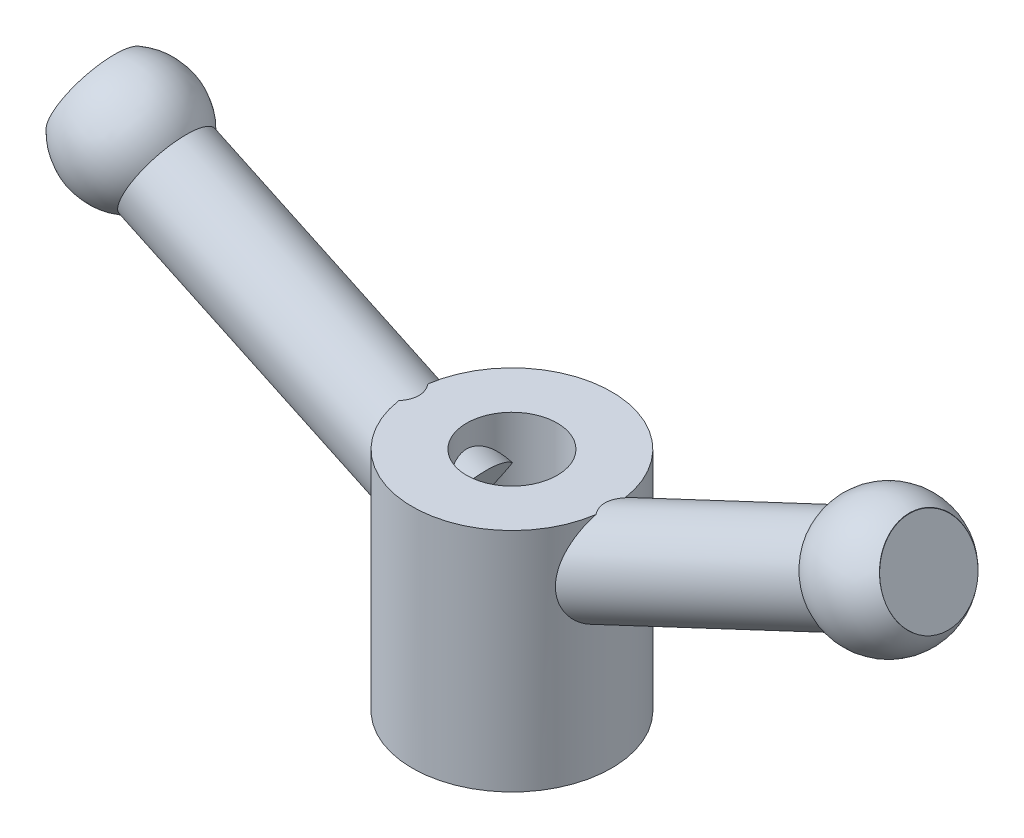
ISO-10303-21;
HEADER;
FILE_DESCRIPTION(('STEP AP214'),'2;1');
FILE_NAME('part.step','',(''),(''),'','','');
FILE_SCHEMA(('AUTOMOTIVE_DESIGN { 1 0 10303 214 1 1 1 1 }'));
ENDSEC;
DATA;
#1=APPLICATION_CONTEXT('core data for automotive mechanical design processes');
#2=APPLICATION_PROTOCOL_DEFINITION('international standard','automotive_design',2000,#1);
#3=PRODUCT_CONTEXT('',#1,'mechanical');
#4=PRODUCT('Part','Part','',(#3));
#5=PRODUCT_RELATED_PRODUCT_CATEGORY('part','',(#4));
#6=PRODUCT_DEFINITION_FORMATION('','',#4);
#7=PRODUCT_DEFINITION_CONTEXT('part definition',#1,'design');
#8=PRODUCT_DEFINITION('design','',#6,#7);
#9=PRODUCT_DEFINITION_SHAPE('','',#8);
#10=(LENGTH_UNIT() NAMED_UNIT(*) SI_UNIT(.MILLI.,.METRE.));
#11=(NAMED_UNIT(*) PLANE_ANGLE_UNIT() SI_UNIT($,.RADIAN.));
#12=(NAMED_UNIT(*) SI_UNIT($,.STERADIAN.) SOLID_ANGLE_UNIT());
#13=UNCERTAINTY_MEASURE_WITH_UNIT(LENGTH_MEASURE(1.E-05),#10,'distance_accuracy_value','');
#14=(GEOMETRIC_REPRESENTATION_CONTEXT(3) GLOBAL_UNCERTAINTY_ASSIGNED_CONTEXT((#13)) GLOBAL_UNIT_ASSIGNED_CONTEXT((#10,
#11,#12)) REPRESENTATION_CONTEXT('',''));
#15=CARTESIAN_POINT('',(0.,0.,0.));
#16=DIRECTION('',(0.,0.,1.));
#17=DIRECTION('',(1.,0.,0.));
#18=AXIS2_PLACEMENT_3D('',#15,#16,#17);
#19=CARTESIAN_POINT('',(73.0543247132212,57.6013931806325,0.));
#20=DIRECTION('',(-0.904975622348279,-0.425463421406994,0.));
#21=DIRECTION('',(0.425463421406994,-0.904975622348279,0.));
#22=AXIS2_PLACEMENT_3D('',#19,#20,#21);
#23=CYLINDRICAL_SURFACE('',#22,7.9375);
#24=CARTESIAN_POINT('',(34.9508455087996,39.6875,0.));
#25=DIRECTION('',(0.,1.,0.));
#26=DIRECTION('',(-1.,0.,0.));
#27=AXIS2_PLACEMENT_3D('',#24,#25,#26);
#28=ELLIPSE('',#27,18.6561278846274,7.9375);
#29=CARTESIAN_POINT('',(17.2766160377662,39.6875,2.54115023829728));
#30=VERTEX_POINT('',#29);
#31=CARTESIAN_POINT('',(17.2766160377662,39.6875,-2.54115023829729));
#32=VERTEX_POINT('',#31);
#33=EDGE_CURVE('E166',#30,#32,#28,.F.);
#34=ORIENTED_EDGE('',*,*,#33,.F.);
#35=CARTESIAN_POINT('',(17.4625,22.6946098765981,0.));
#36=CARTESIAN_POINT('',(17.4625048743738,22.6946073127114,-0.22296311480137));
#37=CARTESIAN_POINT('',(17.4582238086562,22.702982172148,-0.445868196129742));
#38=CARTESIAN_POINT('',(17.441212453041,22.7364523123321,-0.890160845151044));
#39=CARTESIAN_POINT('',(17.4284808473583,22.7615501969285,-1.11154817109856));
#40=CARTESIAN_POINT('',(17.3948563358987,22.8284178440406,-1.55130978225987));
#41=CARTESIAN_POINT('',(17.3739578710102,22.8701989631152,-1.76968191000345));
#42=CARTESIAN_POINT('',(17.3245098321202,22.9703024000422,-2.20171130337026));
#43=CARTESIAN_POINT('',(17.2959605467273,23.0286240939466,-2.4153687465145));
#44=CARTESIAN_POINT('',(17.2319160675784,23.1616208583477,-2.83642728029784));
#45=CARTESIAN_POINT('',(17.1964218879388,23.2362935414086,-3.0438292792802));
#46=CARTESIAN_POINT('',(17.1193710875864,23.4017651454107,-3.45093610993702));
#47=CARTESIAN_POINT('',(17.0778143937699,23.4925642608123,-3.65064084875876));
#48=CARTESIAN_POINT('',(16.9897030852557,23.6899870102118,-4.04090501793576));
#49=CARTESIAN_POINT('',(16.9431487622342,23.7966097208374,-4.23146498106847));
#50=CARTESIAN_POINT('',(16.8462646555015,24.0253082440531,-4.60206012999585));
#51=CARTESIAN_POINT('',(16.7959349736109,24.1473836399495,-4.78209559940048));
#52=CARTESIAN_POINT('',(16.6931479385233,24.4058073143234,-5.12935997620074));
#53=CARTESIAN_POINT('',(16.6407037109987,24.5420739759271,-5.29665347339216));
#54=CARTESIAN_POINT('',(16.5348921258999,24.82882966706,-5.61826594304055));
#55=CARTESIAN_POINT('',(16.4815247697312,24.9793186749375,-5.77258493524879));
#56=CARTESIAN_POINT('',(16.3754253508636,25.293697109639,-6.06702881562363));
#57=CARTESIAN_POINT('',(16.3226930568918,25.4575814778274,-6.20715901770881));
#58=CARTESIAN_POINT('',(16.2194078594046,25.7978342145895,-6.47224526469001));
#59=CARTESIAN_POINT('',(16.1688548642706,25.974202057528,-6.59720194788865));
#60=CARTESIAN_POINT('',(16.0732798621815,26.3313899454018,-6.82667212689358));
#61=CARTESIAN_POINT('',(16.0281213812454,26.511793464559,-6.93177749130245));
#62=CARTESIAN_POINT('',(15.9424806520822,26.8818111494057,-7.12653786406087));
#63=CARTESIAN_POINT('',(15.9019982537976,27.0714250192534,-7.21619336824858));
#64=CARTESIAN_POINT('',(15.8267951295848,27.4584038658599,-7.37967232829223));
#65=CARTESIAN_POINT('',(15.7920731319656,27.6557671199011,-7.45349927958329));
#66=CARTESIAN_POINT('',(15.7292260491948,28.0567515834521,-7.58522815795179));
#67=CARTESIAN_POINT('',(15.7011009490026,28.2603727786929,-7.64313012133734));
#68=CARTESIAN_POINT('',(15.6526270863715,28.6672262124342,-7.7419069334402));
#69=CARTESIAN_POINT('',(15.6321042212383,28.8703450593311,-7.78316522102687));
#70=CARTESIAN_POINT('',(15.5981536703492,29.2796681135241,-7.85098384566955));
#71=CARTESIAN_POINT('',(15.5847285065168,29.485873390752,-7.87753895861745));
#72=CARTESIAN_POINT('',(15.5650236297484,29.8999288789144,-7.91640186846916));
#73=CARTESIAN_POINT('',(15.558743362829,30.1077789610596,-7.92871076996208));
#74=CARTESIAN_POINT('',(15.5531554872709,30.5239890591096,-7.93966579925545));
#75=CARTESIAN_POINT('',(15.5538504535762,30.732349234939,-7.93830688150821));
#76=CARTESIAN_POINT('',(15.5622598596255,31.1677353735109,-7.92180993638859));
#77=CARTESIAN_POINT('',(15.5706192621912,31.3947004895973,-7.90540581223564));
#78=CARTESIAN_POINT('',(15.5946835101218,31.8467544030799,-7.85782761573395));
#79=CARTESIAN_POINT('',(15.6103914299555,32.0718423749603,-7.8266473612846));
#80=CARTESIAN_POINT('',(15.6484565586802,32.5191574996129,-7.75026014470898));
#81=CARTESIAN_POINT('',(15.6708170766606,32.7413831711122,-7.70504620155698));
#82=CARTESIAN_POINT('',(15.721409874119,33.1819389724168,-7.60128294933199));
#83=CARTESIAN_POINT('',(15.7496406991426,33.4002700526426,-7.54273694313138));
#84=CARTESIAN_POINT('',(15.8174647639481,33.8764280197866,-7.39960878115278));
#85=CARTESIAN_POINT('',(15.8582010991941,34.1332314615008,-7.31215193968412));
#86=CARTESIAN_POINT('',(15.945654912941,34.6390348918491,-7.11942343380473));
#87=CARTESIAN_POINT('',(15.9923732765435,34.8880337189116,-7.01414913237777));
#88=CARTESIAN_POINT('',(16.0904388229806,35.3772224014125,-6.7861694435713));
#89=CARTESIAN_POINT('',(16.1417896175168,35.6174051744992,-6.66345041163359));
#90=CARTESIAN_POINT('',(16.2476941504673,36.0874685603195,-6.40088907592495));
#91=CARTESIAN_POINT('',(16.3022476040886,36.3173500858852,-6.26104829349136));
#92=CARTESIAN_POINT('',(16.4104845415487,36.7546099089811,-5.9714019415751));
#93=CARTESIAN_POINT('',(16.4640840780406,36.9625387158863,-5.82239695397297));
#94=CARTESIAN_POINT('',(16.5716449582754,37.3662563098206,-5.50880916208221));
#95=CARTESIAN_POINT('',(16.6256063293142,37.5620441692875,-5.34422516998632));
#96=CARTESIAN_POINT('',(16.7324599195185,37.9393416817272,-4.99961557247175));
#97=CARTESIAN_POINT('',(16.7853536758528,38.1208731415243,-4.81961446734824));
#98=CARTESIAN_POINT('',(16.8886919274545,38.4677227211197,-4.44398514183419));
#99=CARTESIAN_POINT('',(16.9391362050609,38.633039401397,-4.24835553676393));
#100=CARTESIAN_POINT('',(17.059196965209,39.019474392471,-3.7440648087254));
#101=CARTESIAN_POINT('',(17.1264615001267,39.2295269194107,-3.42604879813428));
#102=CARTESIAN_POINT('',(17.2164656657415,39.5056608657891,-2.92591856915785));
#103=CARTESIAN_POINT('',(17.2446558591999,39.5912270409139,-2.75532345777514));
#104=CARTESIAN_POINT('',(17.2967035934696,39.7480274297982,-2.40705120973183));
#105=CARTESIAN_POINT('',(17.3205630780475,39.8192680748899,-2.22937729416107));
#106=CARTESIAN_POINT('',(17.363486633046,39.9467095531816,-1.86602551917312));
#107=CARTESIAN_POINT('',(17.3824981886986,40.0027460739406,-1.6802835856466));
#108=CARTESIAN_POINT('',(17.4147740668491,40.0975154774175,-1.30391958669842));
#109=CARTESIAN_POINT('',(17.4280384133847,40.1362484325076,-1.11329754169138));
#110=CARTESIAN_POINT('',(17.4483340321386,40.1953956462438,-0.729056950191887));
#111=CARTESIAN_POINT('',(17.4553705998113,40.2158254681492,-0.53544109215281));
#112=CARTESIAN_POINT('',(17.4629607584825,40.2378596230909,-0.147025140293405));
#113=CARTESIAN_POINT('',(17.4635153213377,40.2394667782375,0.0477747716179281));
#114=CARTESIAN_POINT('',(17.4585291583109,40.2249955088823,0.407487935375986));
#115=CARTESIAN_POINT('',(17.4538852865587,40.2115193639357,0.572524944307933));
#116=CARTESIAN_POINT('',(17.440023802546,40.1711894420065,0.900815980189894));
#117=CARTESIAN_POINT('',(17.4308047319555,40.144331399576,1.06406942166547));
#118=CARTESIAN_POINT('',(17.4080402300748,40.0777542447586,1.38756406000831));
#119=CARTESIAN_POINT('',(17.3944959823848,40.0380386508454,1.5478060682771));
#120=CARTESIAN_POINT('',(17.3634137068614,39.9464261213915,1.86442766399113));
#121=CARTESIAN_POINT('',(17.3458740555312,39.894524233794,2.02080565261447));
#122=CARTESIAN_POINT('',(17.3070843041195,39.7790006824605,2.32983831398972));
#123=CARTESIAN_POINT('',(17.28581122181,39.7153062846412,2.48246282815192));
#124=CARTESIAN_POINT('',(17.24007999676,39.577310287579,2.78236960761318));
#125=CARTESIAN_POINT('',(17.2156208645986,39.5030053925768,2.92965019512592));
#126=CARTESIAN_POINT('',(17.1381633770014,39.2655442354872,3.36277168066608));
#127=CARTESIAN_POINT('',(17.0810770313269,39.087818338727,3.63995277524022));
#128=CARTESIAN_POINT('',(16.9267419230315,38.595223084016,4.31276707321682));
#129=CARTESIAN_POINT('',(16.8245001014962,38.2582443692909,4.69113311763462));
#130=CARTESIAN_POINT('',(16.6673503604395,37.7109960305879,5.21261989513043));
#131=CARTESIAN_POINT('',(16.6142626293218,37.5213356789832,5.37896267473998));
#132=CARTESIAN_POINT('',(16.5080739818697,37.1296787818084,5.69652568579));
#133=CARTESIAN_POINT('',(16.4549730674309,36.9276834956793,5.84774745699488));
#134=CARTESIAN_POINT('',(16.3488529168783,36.5083660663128,6.13827097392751));
#135=CARTESIAN_POINT('',(16.2958616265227,36.2908033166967,6.27723385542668));
#136=CARTESIAN_POINT('',(16.192433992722,35.8458041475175,6.53940660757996));
#137=CARTESIAN_POINT('',(16.1419976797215,35.6183676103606,6.66261629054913));
#138=CARTESIAN_POINT('',(16.0448838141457,35.1546406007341,6.89320477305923));
#139=CARTESIAN_POINT('',(15.998208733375,34.9183444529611,7.00057319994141));
#140=CARTESIAN_POINT('',(15.9098816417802,34.4380858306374,7.19905333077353));
#141=CARTESIAN_POINT('',(15.8682301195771,34.1941226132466,7.29016345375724));
#142=CARTESIAN_POINT('',(15.7838743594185,33.6526042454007,7.47128006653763));
#143=CARTESIAN_POINT('',(15.7424708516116,33.3536660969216,7.55779473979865));
#144=CARTESIAN_POINT('',(15.6706091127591,32.7482373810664,7.70569215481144));
#145=CARTESIAN_POINT('',(15.6401533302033,32.4417451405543,7.76706927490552));
#146=CARTESIAN_POINT('',(15.5922426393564,31.8240949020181,7.8628081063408));
#147=CARTESIAN_POINT('',(15.5747637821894,31.5129465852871,7.89721958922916));
#148=CARTESIAN_POINT('',(15.5544722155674,30.8883664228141,7.93711939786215));
#149=CARTESIAN_POINT('',(15.5516514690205,30.5749359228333,7.94262357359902));
#150=CARTESIAN_POINT('',(15.5602912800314,30.0447082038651,7.92566922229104));
#151=CARTESIAN_POINT('',(15.5676627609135,29.8275622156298,7.91121882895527));
#152=CARTESIAN_POINT('',(15.5902160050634,29.3953048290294,7.86668394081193));
#153=CARTESIAN_POINT('',(15.6053958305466,29.1801929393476,7.8366033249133));
#154=CARTESIAN_POINT('',(15.6434713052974,28.7536886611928,7.76031713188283));
#155=CARTESIAN_POINT('',(15.6663614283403,28.5422937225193,7.71412310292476));
#156=CARTESIAN_POINT('',(15.7194864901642,28.1247043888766,7.60528208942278));
#157=CARTESIAN_POINT('',(15.74972168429,27.9185101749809,7.54263453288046));
#158=CARTESIAN_POINT('',(15.816967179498,27.5123553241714,7.40058396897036));
#159=CARTESIAN_POINT('',(15.8539986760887,27.3124165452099,7.32112842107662));
#160=CARTESIAN_POINT('',(15.9338034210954,26.921074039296,7.14577390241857));
#161=CARTESIAN_POINT('',(15.9765766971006,26.7296703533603,7.04987485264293));
#162=CARTESIAN_POINT('',(16.0666710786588,26.3568166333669,6.84206154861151));
#163=CARTESIAN_POINT('',(16.1139935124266,26.1753695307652,6.73014261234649));
#164=CARTESIAN_POINT('',(16.2117999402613,25.8237704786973,6.4910034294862));
#165=CARTESIAN_POINT('',(16.2622838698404,25.6536182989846,6.36378349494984));
#166=CARTESIAN_POINT('',(16.3625459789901,25.3333418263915,6.10121341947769));
#167=CARTESIAN_POINT('',(16.4122469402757,25.1826532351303,5.96652079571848));
#168=CARTESIAN_POINT('',(16.5119180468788,24.8932067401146,5.68487332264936));
#169=CARTESIAN_POINT('',(16.5618882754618,24.7544527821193,5.53791444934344));
#170=CARTESIAN_POINT('',(16.6608212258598,24.4895366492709,5.23274933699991));
#171=CARTESIAN_POINT('',(16.7097839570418,24.3633743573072,5.07454320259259));
#172=CARTESIAN_POINT('',(16.8055102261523,24.1241131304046,4.7479147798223));
#173=CARTESIAN_POINT('',(16.8522736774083,24.0110147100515,4.57949208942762));
#174=CARTESIAN_POINT('',(16.9441933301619,23.7942639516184,4.22701046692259));
#175=CARTESIAN_POINT('',(16.9892230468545,23.6911264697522,4.04260175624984));
#176=CARTESIAN_POINT('',(17.0746035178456,23.4996973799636,3.66527374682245));
#177=CARTESIAN_POINT('',(17.1149556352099,23.4114014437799,3.47235695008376));
#178=CARTESIAN_POINT('',(17.1900183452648,23.249912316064,3.07931346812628));
#179=CARTESIAN_POINT('',(17.2247308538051,23.1767139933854,2.87918925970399));
#180=CARTESIAN_POINT('',(17.2877155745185,23.0456116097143,2.47306881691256));
#181=CARTESIAN_POINT('',(17.3159886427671,22.9877055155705,2.26707336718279));
#182=CARTESIAN_POINT('',(17.3804960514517,22.856773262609,1.72362526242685));
#183=CARTESIAN_POINT('',(17.4111051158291,22.7959896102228,1.38245970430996));
#184=CARTESIAN_POINT('',(17.4521035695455,22.7149093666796,0.694149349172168));
#185=CARTESIAN_POINT('',(17.4624924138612,22.6946138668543,0.347004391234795));
#186=CARTESIAN_POINT('',(17.4625,22.6946098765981,0.));
#187=B_SPLINE_CURVE_WITH_KNOTS('',3,(#35,#36,#37,#38,#39,#40,#41,#42,#43,#44,#45,#46,#47,#48,
#49,#50,#51,#52,#53,#54,#55,#56,#57,#58,#59,#60,#61,#62,#63,#64,#65,#66,#67,#68,#69,#70,#71,#72,
#73,#74,#75,#76,#77,#78,#79,#80,#81,#82,#83,#84,#85,#86,#87,#88,#89,#90,#91,#92,#93,#94,#95,#96,
#97,#98,#99,#100,#101,#102,#103,#104,#105,#106,#107,#108,#109,#110,#111,#112,#113,#114,#115,
#116,#117,#118,#119,#120,#121,#122,#123,#124,#125,#126,#127,#128,#129,#130,#131,#132,#133,#134,
#135,#136,#137,#138,#139,#140,#141,#142,#143,#144,#145,#146,#147,#148,#149,#150,#151,#152,#153,
#154,#155,#156,#157,#158,#159,#160,#161,#162,#163,#164,#165,#166,#167,#168,#169,#170,#171,#172,
#173,#174,#175,#176,#177,#178,#179,#180,#181,#182,#183,#184,#185,#186),.UNSPECIFIED.,.T.,.F.,(4,
2,2,2,2,2,2,2,2,2,2,2,2,2,2,2,2,2,2,2,2,2,2,2,2,2,2,2,2,2,2,2,2,2,2,2,2,2,2,2,2,2,2,2,2,2,2,2,2,
2,2,2,2,2,2,2,2,2,2,2,2,2,2,2,2,2,2,2,2,2,2,2,2,2,2,4),(0.,0.668591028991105,1.33728618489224,
2.00643731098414,2.67556319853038,3.34459145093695,4.01362777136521,4.68262506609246,
5.35160432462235,6.01692891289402,6.68225248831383,7.34732596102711,8.01237144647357,
8.65241943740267,9.29244688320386,9.93233284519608,10.5722173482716,11.1963782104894,
11.8207606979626,12.4450947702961,13.0696593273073,13.752141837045,14.4349101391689,
15.1180186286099,15.8009580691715,16.6231416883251,17.4454470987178,18.2683992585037,
19.0912783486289,19.874656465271,20.6580943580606,21.440309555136,22.2225941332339,
23.3785561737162,23.9567530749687,24.5346898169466,25.1186438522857,25.7025954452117,
26.2860500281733,26.8694171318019,27.3657673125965,27.8622758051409,28.358648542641,
28.8552233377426,29.3549696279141,29.8548714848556,30.8544813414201,32.3961123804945,
33.1689915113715,33.9417918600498,34.7317364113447,35.5216903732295,36.3121593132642,
37.1027050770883,38.043300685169,38.9841065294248,39.9231717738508,40.8617220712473,
41.5143373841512,42.1667908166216,42.8187776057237,43.4707870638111,44.124865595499,
44.7789472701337,45.433220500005,46.0874803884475,46.7111737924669,47.3350726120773,
47.9589656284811,48.5828832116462,49.2302527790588,49.8774332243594,50.524393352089,
51.171267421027,52.2117882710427,53.2523371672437),.UNSPECIFIED.);
#188=EDGE_CURVE('E62',#30,#32,#187,.T.);
#189=ORIENTED_EDGE('',*,*,#188,.T.);
#190=EDGE_LOOP('',(#34,#189));
#191=FACE_BOUND('',#190,.T.);
#192=CARTESIAN_POINT('',(73.0543247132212,57.6013931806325,0.));
#193=DIRECTION('',(0.904975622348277,0.425463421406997,0.));
#194=DIRECTION('',(-0.425463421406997,0.904975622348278,0.));
#195=AXIS2_PLACEMENT_3D('',#192,#193,#194);
#196=CIRCLE('',#195,7.9375);
#197=CARTESIAN_POINT('',(73.0300129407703,57.6531051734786,-7.93729431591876));
#198=VERTEX_POINT('',#197);
#199=CARTESIAN_POINT('',(73.0300129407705,57.6531051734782,7.93729431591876));
#200=VERTEX_POINT('',#199);
#201=EDGE_CURVE('E165',#198,#200,#196,.T.);
#202=ORIENTED_EDGE('',*,*,#201,.F.);
#203=DIRECTION('',(-0.904975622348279,-0.425463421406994,0.));
#204=VECTOR('',#203,1.);
#205=CARTESIAN_POINT('',(65.979744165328,54.3385059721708,-7.93729431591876));
#206=LINE('',#205,#204);
#207=CARTESIAN_POINT('',(58.9534231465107,51.0351655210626,-7.93729431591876));
#208=VERTEX_POINT('',#207);
#209=EDGE_CURVE('E101',#198,#208,#206,.T.);
#210=ORIENTED_EDGE('',*,*,#209,.T.);
#211=CARTESIAN_POINT('',(55.5711780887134,58.0675007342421,-1.10466829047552));
#212=CARTESIAN_POINT('',(55.5846333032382,58.0395220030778,-1.3257395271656));
#213=CARTESIAN_POINT('',(55.6021505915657,58.0030966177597,-1.54549000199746));
#214=CARTESIAN_POINT('',(55.6451390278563,57.9137068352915,-1.98079878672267));
#215=CARTESIAN_POINT('',(55.6706097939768,57.8607432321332,-2.19635729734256));
#216=CARTESIAN_POINT('',(55.7293155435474,57.7386715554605,-2.62160324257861));
#217=CARTESIAN_POINT('',(55.7625450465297,57.6695748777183,-2.83129470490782));
#218=CARTESIAN_POINT('',(55.8365383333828,57.5157154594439,-3.24347405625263));
#219=CARTESIAN_POINT('',(55.8773020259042,57.4309529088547,-3.44596203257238));
#220=CARTESIAN_POINT('',(55.9660958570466,57.2463189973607,-3.84238992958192));
#221=CARTESIAN_POINT('',(56.0141293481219,57.1464406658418,-4.03632585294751));
#222=CARTESIAN_POINT('',(56.1171080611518,56.9323131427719,-4.41417408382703));
#223=CARTESIAN_POINT('',(56.1720533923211,56.8180637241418,-4.59808623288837));
#224=CARTESIAN_POINT('',(56.2884528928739,56.5760321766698,-4.9545399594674));
#225=CARTESIAN_POINT('',(56.3499057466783,56.4482527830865,-5.12708382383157));
#226=CARTESIAN_POINT('',(56.4788924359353,56.180051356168,-5.45961456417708));
#227=CARTESIAN_POINT('',(56.5464262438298,56.0396293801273,-5.61960149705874));
#228=CARTESIAN_POINT('',(56.6870862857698,55.7471590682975,-5.92586286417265));
#229=CARTESIAN_POINT('',(56.7602118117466,55.5951122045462,-6.07213902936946));
#230=CARTESIAN_POINT('',(56.9115695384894,55.2804025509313,-6.35001064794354));
#231=CARTESIAN_POINT('',(56.9898034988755,55.1177361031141,-6.48160099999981));
#232=CARTESIAN_POINT('',(57.1507969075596,54.7829961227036,-6.72910353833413));
#233=CARTESIAN_POINT('',(57.2335562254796,54.6109228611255,-6.84501617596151));
#234=CARTESIAN_POINT('',(57.4030154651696,54.258585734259,-7.06034549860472));
#235=CARTESIAN_POINT('',(57.4897154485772,54.078321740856,-7.15976192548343));
#236=CARTESIAN_POINT('',(57.6664362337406,53.7108921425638,-7.34138759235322));
#237=CARTESIAN_POINT('',(57.7564569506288,53.5237267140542,-7.42359727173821));
#238=CARTESIAN_POINT('',(57.9391834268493,53.1438164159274,-7.57022992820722));
#239=CARTESIAN_POINT('',(58.0318892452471,52.9510714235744,-7.6346525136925));
#240=CARTESIAN_POINT('',(58.2193018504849,52.5614245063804,-7.74523701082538));
#241=CARTESIAN_POINT('',(58.3140081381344,52.3645236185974,-7.79140342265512));
#242=CARTESIAN_POINT('',(58.5048039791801,51.9678493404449,-7.86518303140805));
#243=CARTESIAN_POINT('',(58.6008940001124,51.7680749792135,-7.89278979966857));
#244=CARTESIAN_POINT('',(58.7937293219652,51.3671673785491,-7.92922582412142));
#245=CARTESIAN_POINT('',(58.890474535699,51.1660343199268,-7.93805753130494));
#246=CARTESIAN_POINT('',(59.0839464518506,50.7638101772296,-7.9368879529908));
#247=CARTESIAN_POINT('',(59.1806731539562,50.5627190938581,-7.92688637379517));
#248=CARTESIAN_POINT('',(59.3734190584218,50.162011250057,-7.88812069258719));
#249=CARTESIAN_POINT('',(59.46943825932,49.9623944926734,-7.85935655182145));
#250=CARTESIAN_POINT('',(59.6600884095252,49.566050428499,-7.78326930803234));
#251=CARTESIAN_POINT('',(59.7547193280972,49.3693231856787,-7.735945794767));
#252=CARTESIAN_POINT('',(59.9419006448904,48.9801971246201,-7.62308660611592));
#253=CARTESIAN_POINT('',(60.0344514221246,48.7877975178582,-7.55755427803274));
#254=CARTESIAN_POINT('',(60.2168641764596,48.408591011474,-7.40871361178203));
#255=CARTESIAN_POINT('',(60.3067252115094,48.2217860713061,-7.32539912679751));
#256=CARTESIAN_POINT('',(60.4830692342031,47.8552014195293,-7.141617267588));
#257=CARTESIAN_POINT('',(60.5695528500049,47.6754204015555,-7.04115310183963));
#258=CARTESIAN_POINT('',(60.7385460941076,47.3241220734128,-6.82377352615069));
#259=CARTESIAN_POINT('',(60.8210556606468,47.1526048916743,-6.70685786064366));
#260=CARTESIAN_POINT('',(60.9815097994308,46.8190624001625,-6.4574118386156));
#261=CARTESIAN_POINT('',(61.0594545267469,46.6570367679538,-6.32488201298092));
#262=CARTESIAN_POINT('',(61.2102293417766,46.3436195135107,-6.04514345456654));
#263=CARTESIAN_POINT('',(61.2830593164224,46.1922281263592,-5.89793439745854));
#264=CARTESIAN_POINT('',(61.4230718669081,45.9011863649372,-5.58991454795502));
#265=CARTESIAN_POINT('',(61.490255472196,45.7615338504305,-5.42910624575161));
#266=CARTESIAN_POINT('',(61.6185346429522,45.4948853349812,-5.09494959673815));
#267=CARTESIAN_POINT('',(61.6796280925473,45.3678937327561,-4.92159692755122));
#268=CARTESIAN_POINT('',(61.7952531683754,45.1275514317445,-4.56367252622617));
#269=CARTESIAN_POINT('',(61.8497862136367,45.0141977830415,-4.37910323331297));
#270=CARTESIAN_POINT('',(61.9519187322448,44.8019036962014,-4.00002078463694));
#271=CARTESIAN_POINT('',(61.9995180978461,44.7029634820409,-3.80550747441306));
#272=CARTESIAN_POINT('',(62.0874427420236,44.5202036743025,-3.40792642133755));
#273=CARTESIAN_POINT('',(62.12776816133,44.4363837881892,-3.20485884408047));
#274=CARTESIAN_POINT('',(62.2008599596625,44.2844565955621,-2.79160485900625));
#275=CARTESIAN_POINT('',(62.2336261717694,44.2163496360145,-2.58141829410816));
#276=CARTESIAN_POINT('',(62.2913588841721,44.0963482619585,-2.15547221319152));
#277=CARTESIAN_POINT('',(62.3163271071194,44.0444502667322,-1.93971393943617));
#278=CARTESIAN_POINT('',(62.3583033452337,43.9572001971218,-1.5040379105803));
#279=CARTESIAN_POINT('',(62.3753086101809,43.9218538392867,-1.28411874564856));
#280=CARTESIAN_POINT('',(62.4012227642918,43.8679899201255,-0.841798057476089));
#281=CARTESIAN_POINT('',(62.4101331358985,43.8494692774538,-0.619396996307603));
#282=CARTESIAN_POINT('',(62.4197995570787,43.8293771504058,-0.173649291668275));
#283=CARTESIAN_POINT('',(62.4205554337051,43.8278060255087,0.0496973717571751));
#284=CARTESIAN_POINT('',(62.4139071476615,43.8416248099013,0.495736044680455));
#285=CARTESIAN_POINT('',(62.4065032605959,43.8570141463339,0.718428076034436));
#286=CARTESIAN_POINT('',(62.3835885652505,43.9046435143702,1.16158185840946));
#287=CARTESIAN_POINT('',(62.3680777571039,43.9368835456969,1.38204360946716));
#288=CARTESIAN_POINT('',(62.3290593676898,44.0179854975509,1.81917178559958));
#289=CARTESIAN_POINT('',(62.3055517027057,44.0668475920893,2.03583817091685));
#290=CARTESIAN_POINT('',(62.2507074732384,44.1808449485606,2.46382831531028));
#291=CARTESIAN_POINT('',(62.2193710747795,44.245979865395,2.67515218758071));
#292=CARTESIAN_POINT('',(62.1490855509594,44.3920738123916,3.09099826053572));
#293=CARTESIAN_POINT('',(62.1101350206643,44.473035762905,3.29551919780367));
#294=CARTESIAN_POINT('',(62.0249168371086,44.6501696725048,3.69619477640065));
#295=CARTESIAN_POINT('',(61.9786517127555,44.7463363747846,3.89235227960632));
#296=CARTESIAN_POINT('',(61.8791145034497,44.9532354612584,4.27501726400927));
#297=CARTESIAN_POINT('',(61.8258411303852,45.0639705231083,4.46152296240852));
#298=CARTESIAN_POINT('',(61.7126742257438,45.2992027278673,4.82351568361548));
#299=CARTESIAN_POINT('',(61.6527808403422,45.423699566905,4.99900294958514));
#300=CARTESIAN_POINT('',(61.5267960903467,45.6855782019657,5.33772361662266));
#301=CARTESIAN_POINT('',(61.4607044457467,45.8229605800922,5.50095646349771));
#302=CARTESIAN_POINT('',(61.3227966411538,46.1096265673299,5.81399674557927));
#303=CARTESIAN_POINT('',(61.2509805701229,46.2589099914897,5.96380438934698));
#304=CARTESIAN_POINT('',(61.1021203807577,46.5683465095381,6.2489579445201));
#305=CARTESIAN_POINT('',(61.0250753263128,46.7285015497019,6.38430125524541));
#306=CARTESIAN_POINT('',(60.8663442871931,47.0584612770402,6.63948878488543));
#307=CARTESIAN_POINT('',(60.7846599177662,47.2282626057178,6.75933835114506));
#308=CARTESIAN_POINT('',(60.617188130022,47.5763971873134,6.98276647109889));
#309=CARTESIAN_POINT('',(60.5313998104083,47.7547323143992,7.0863414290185));
#310=CARTESIAN_POINT('',(60.3563488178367,48.118627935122,7.2764501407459));
#311=CARTESIAN_POINT('',(60.2670862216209,48.3041882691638,7.3629842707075));
#312=CARTESIAN_POINT('',(60.08571737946,48.6812234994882,7.51840104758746));
#313=CARTESIAN_POINT('',(59.9936110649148,48.8726985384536,7.58728326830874));
#314=CARTESIAN_POINT('',(59.8072132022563,49.2601946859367,7.70690297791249));
#315=CARTESIAN_POINT('',(59.7129216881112,49.4562157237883,7.75764074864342));
#316=CARTESIAN_POINT('',(59.5228014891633,49.8514568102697,7.84062157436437));
#317=CARTESIAN_POINT('',(59.4269724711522,50.0506775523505,7.87286056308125));
#318=CARTESIAN_POINT('',(59.2345124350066,50.4507898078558,7.9185894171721));
#319=CARTESIAN_POINT('',(59.1378817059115,50.6516807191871,7.93208576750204));
#320=CARTESIAN_POINT('',(58.9444558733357,51.0538077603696,7.94025504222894));
#321=CARTESIAN_POINT('',(58.8476607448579,51.2550439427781,7.93492478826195));
#322=CARTESIAN_POINT('',(58.6546126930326,51.6563925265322,7.90547200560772));
#323=CARTESIAN_POINT('',(58.558359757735,51.8565049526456,7.88134989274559));
#324=CARTESIAN_POINT('',(58.3670759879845,52.25419239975,7.81448458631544));
#325=CARTESIAN_POINT('',(58.2720451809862,52.451767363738,7.77174097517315));
#326=CARTESIAN_POINT('',(58.0838848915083,52.8429675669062,7.66793721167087));
#327=CARTESIAN_POINT('',(57.9907553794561,53.0365928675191,7.60687734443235));
#328=CARTESIAN_POINT('',(57.8070380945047,53.4185620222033,7.46685952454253));
#329=CARTESIAN_POINT('',(57.7164508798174,53.6069047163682,7.3878976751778));
#330=CARTESIAN_POINT('',(57.5385143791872,53.9768608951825,7.21267523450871));
#331=CARTESIAN_POINT('',(57.4511639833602,54.1584766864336,7.11642064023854));
#332=CARTESIAN_POINT('',(57.2802735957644,54.5137884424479,6.90725973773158));
#333=CARTESIAN_POINT('',(57.1967342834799,54.6874829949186,6.7943504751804));
#334=CARTESIAN_POINT('',(57.0340783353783,55.0256788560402,6.55269832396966));
#335=CARTESIAN_POINT('',(56.954961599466,55.190180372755,6.42395579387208));
#336=CARTESIAN_POINT('',(56.8017131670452,55.5088204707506,6.1515538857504));
#337=CARTESIAN_POINT('',(56.7275813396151,55.6629593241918,6.00789489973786));
#338=CARTESIAN_POINT('',(56.584828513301,55.9597804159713,5.70668084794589));
#339=CARTESIAN_POINT('',(56.5162074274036,56.102462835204,5.54912600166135));
#340=CARTESIAN_POINT('',(56.3849445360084,56.3753965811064,5.22119349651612));
#341=CARTESIAN_POINT('',(56.3223043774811,56.5056444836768,5.05081232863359));
#342=CARTESIAN_POINT('',(56.2034911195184,56.7526945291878,4.698538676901));
#343=CARTESIAN_POINT('',(56.1473157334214,56.8695014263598,4.51665029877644));
#344=CARTESIAN_POINT('',(56.0418033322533,57.088896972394,4.14259467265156));
#345=CARTESIAN_POINT('',(55.9924666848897,57.1914848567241,3.95042687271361));
#346=CARTESIAN_POINT('',(55.9009903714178,57.3816963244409,3.55720101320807));
#347=CARTESIAN_POINT('',(55.8588496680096,57.4693220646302,3.35614424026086));
#348=CARTESIAN_POINT('',(55.7898637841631,57.6127690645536,2.98819827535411));
#349=CARTESIAN_POINT('',(55.7616504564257,57.6714351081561,2.82266539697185));
#350=CARTESIAN_POINT('',(55.7101043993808,57.7786188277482,2.4876058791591));
#351=CARTESIAN_POINT('',(55.6867713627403,57.8271371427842,2.31807949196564));
#352=CARTESIAN_POINT('',(55.6451106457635,57.9137658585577,1.97594681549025));
#353=CARTESIAN_POINT('',(55.6267785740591,57.9518853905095,1.80334337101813));
#354=CARTESIAN_POINT('',(55.5951673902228,58.0176174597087,1.45566119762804));
#355=CARTESIAN_POINT('',(55.5818891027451,58.0452282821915,1.28058206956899));
#356=CARTESIAN_POINT('',(55.5711780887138,58.0675007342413,1.10466829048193));
#357=B_SPLINE_CURVE_WITH_KNOTS('',3,(#211,#212,#213,#214,#215,#216,#217,#218,#219,#220,#221,
#222,#223,#224,#225,#226,#227,#228,#229,#230,#231,#232,#233,#234,#235,#236,#237,#238,#239,#240,
#241,#242,#243,#244,#245,#246,#247,#248,#249,#250,#251,#252,#253,#254,#255,#256,#257,#258,#259,
#260,#261,#262,#263,#264,#265,#266,#267,#268,#269,#270,#271,#272,#273,#274,#275,#276,#277,#278,
#279,#280,#281,#282,#283,#284,#285,#286,#287,#288,#289,#290,#291,#292,#293,#294,#295,#296,#297,
#298,#299,#300,#301,#302,#303,#304,#305,#306,#307,#308,#309,#310,#311,#312,#313,#314,#315,#316,
#317,#318,#319,#320,#321,#322,#323,#324,#325,#326,#327,#328,#329,#330,#331,#332,#333,#334,#335,
#336,#337,#338,#339,#340,#341,#342,#343,#344,#345,#346,#347,#348,#349,#350,#351,#352,#353,#354,
#355,#356),.UNSPECIFIED.,.F.,.F.,(4,2,2,2,2,2,2,2,2,2,2,2,2,2,2,2,2,2,2,2,2,2,2,2,2,2,2,2,2,2,2,
2,2,2,2,2,2,2,2,2,2,2,2,2,2,2,2,2,2,2,2,2,2,2,2,2,2,2,2,2,2,2,2,2,2,2,2,2,2,2,2,2,4),(0.,
0.669517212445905,1.33900228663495,2.00801588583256,2.67702137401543,3.34633631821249,
4.01566183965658,4.68485230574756,5.3540397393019,6.0231425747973,6.6924771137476,
7.36179237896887,8.03111811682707,8.70042676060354,9.36975013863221,10.0389084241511,
10.7082983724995,11.3776009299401,12.0469139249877,12.7162283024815,13.385557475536,
14.0547636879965,14.7242016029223,15.3935144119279,16.0628376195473,16.7321380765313,
17.4014533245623,18.070646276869,18.7400709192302,19.4093505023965,20.078640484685,
20.7479175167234,21.4172093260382,22.0863531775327,22.755727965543,23.4249801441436,
24.0942465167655,24.7634902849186,25.4327340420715,26.1019848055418,26.7712213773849,
27.4405815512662,28.1097108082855,28.778963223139,29.4482008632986,30.1174687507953,
30.7867262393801,31.4561038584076,32.1252498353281,32.7945434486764,33.4638222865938,
34.1331172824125,34.8024018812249,35.4718335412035,36.1410335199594,36.8103464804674,
37.4796446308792,38.1489577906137,38.8182605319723,39.4877091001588,40.1569259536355,
40.8262616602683,41.4955822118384,42.1648851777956,42.8341775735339,43.5036537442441,
44.1728923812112,44.8421669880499,45.51134503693,46.0445815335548,46.5777844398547,
47.1105176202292,47.643337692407),.UNSPECIFIED.);
#358=CARTESIAN_POINT('',(58.9534231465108,51.0351655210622,7.93729431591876));
#359=VERTEX_POINT('',#358);
#360=EDGE_CURVE('E106',#208,#359,#357,.T.);
#361=ORIENTED_EDGE('',*,*,#360,.T.);
#362=DIRECTION('',(-0.904975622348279,-0.425463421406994,0.));
#363=VECTOR('',#362,1.);
#364=CARTESIAN_POINT('',(65.9797441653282,54.3385059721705,7.93729431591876));
#365=LINE('',#364,#363);
#366=EDGE_CURVE('E92',#359,#200,#365,.F.);
#367=ORIENTED_EDGE('',*,*,#366,.T.);
#368=EDGE_LOOP('',(#202,#210,#361,#367));
#369=FACE_BOUND('',#368,.T.);
#370=ADVANCED_FACE('F38',(#191,#369),#23,.T.);
#371=CARTESIAN_POINT('',(0.,39.6875,0.));
#372=DIRECTION('',(0.,1.,0.));
#373=DIRECTION('',(0.,0.,1.));
#374=AXIS2_PLACEMENT_3D('',#371,#372,#373);
#375=PLANE('',#374);
#376=CARTESIAN_POINT('',(0.,39.6875,0.));
#377=DIRECTION('',(0.,1.,0.));
#378=DIRECTION('',(0.,0.,1.));
#379=AXIS2_PLACEMENT_3D('',#376,#377,#378);
#380=CIRCLE('',#379,7.9375);
#381=CARTESIAN_POINT('',(0.,39.6875,7.9375));
#382=VERTEX_POINT('',#381);
#383=EDGE_CURVE('E212',#382,#382,#380,.T.);
#384=ORIENTED_EDGE('',*,*,#383,.F.);
#385=EDGE_LOOP('',(#384));
#386=FACE_BOUND('',#385,.T.);
#387=CARTESIAN_POINT('',(0.,39.6875,0.));
#388=DIRECTION('',(0.,1.,0.));
#389=DIRECTION('',(0.,0.,1.));
#390=AXIS2_PLACEMENT_3D('',#387,#388,#389);
#391=CIRCLE('',#390,17.4625);
#392=CARTESIAN_POINT('',(-17.2766160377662,39.6875,2.54115023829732));
#393=VERTEX_POINT('',#392);
#394=EDGE_CURVE('E217',#393,#30,#391,.T.);
#395=ORIENTED_EDGE('',*,*,#394,.T.);
#396=ORIENTED_EDGE('',*,*,#33,.T.);
#397=CARTESIAN_POINT('',(-17.2766160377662,39.6875,-2.5411502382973));
#398=VERTEX_POINT('',#397);
#399=EDGE_CURVE('E220',#32,#398,#391,.T.);
#400=ORIENTED_EDGE('',*,*,#399,.T.);
#401=CARTESIAN_POINT('',(-34.9508455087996,39.6875,0.));
#402=DIRECTION('',(0.,1.,0.));
#403=DIRECTION('',(1.,0.,0.));
#404=AXIS2_PLACEMENT_3D('',#401,#402,#403);
#405=ELLIPSE('',#404,18.6561278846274,7.9375);
#406=EDGE_CURVE('E187',#393,#398,#405,.T.);
#407=ORIENTED_EDGE('',*,*,#406,.F.);
#408=EDGE_LOOP('',(#395,#396,#400,#407));
#409=FACE_BOUND('',#408,.T.);
#410=ADVANCED_FACE('F150',(#386,#409),#375,.T.);
#411=CARTESIAN_POINT('',(0.,39.6875,0.));
#412=DIRECTION('',(0.,-1.,0.));
#413=DIRECTION('',(0.,0.,-1.));
#414=AXIS2_PLACEMENT_3D('',#411,#412,#413);
#415=CYLINDRICAL_SURFACE('',#414,17.4625);
#416=CARTESIAN_POINT('',(0.,0.,0.));
#417=DIRECTION('',(0.,1.,0.));
#418=DIRECTION('',(0.,0.,1.));
#419=AXIS2_PLACEMENT_3D('',#416,#417,#418);
#420=CIRCLE('',#419,17.4625);
#421=CARTESIAN_POINT('',(0.,0.,17.4625));
#422=VERTEX_POINT('',#421);
#423=EDGE_CURVE('E208',#422,#422,#420,.T.);
#424=ORIENTED_EDGE('',*,*,#423,.T.);
#425=EDGE_LOOP('',(#424));
#426=FACE_BOUND('',#425,.T.);
#427=ORIENTED_EDGE('',*,*,#188,.F.);
#428=ORIENTED_EDGE('',*,*,#394,.F.);
#429=CARTESIAN_POINT('',(-17.2766160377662,39.6875,2.54115023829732));
#430=CARTESIAN_POINT('',(-17.2449527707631,39.5922084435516,2.7564640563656));
#431=CARTESIAN_POINT('',(-17.2099937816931,39.4860962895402,2.96614326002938));
#432=CARTESIAN_POINT('',(-17.1348490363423,39.2548331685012,3.3732098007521));
#433=CARTESIAN_POINT('',(-17.0946737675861,39.129720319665,3.57062065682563));
#434=CARTESIAN_POINT('',(-16.9688972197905,38.7314941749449,4.14078687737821));
#435=CARTESIAN_POINT('',(-16.8774401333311,38.4337245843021,4.49529554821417));
#436=CARTESIAN_POINT('',(-16.7247589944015,37.9127599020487,5.02651708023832));
#437=CARTESIAN_POINT('',(-16.6653873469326,37.7047436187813,5.21928573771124));
#438=CARTESIAN_POINT('',(-16.5461699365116,37.2725108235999,5.58571716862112));
#439=CARTESIAN_POINT('',(-16.4863241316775,37.0482928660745,5.75937823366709));
#440=CARTESIAN_POINT('',(-16.3677144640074,36.5850428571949,6.08831241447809));
#441=CARTESIAN_POINT('',(-16.3089563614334,36.3459512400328,6.24350323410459));
#442=CARTESIAN_POINT('',(-16.1944848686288,35.8556720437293,6.53467868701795));
#443=CARTESIAN_POINT('',(-16.1387713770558,35.6044848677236,6.67066395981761));
#444=CARTESIAN_POINT('',(-16.031359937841,35.0882711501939,6.92486028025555));
#445=CARTESIAN_POINT('',(-15.979723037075,34.8231079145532,7.04281950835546));
#446=CARTESIAN_POINT('',(-15.8829904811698,34.283425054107,7.25833821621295));
#447=CARTESIAN_POINT('',(-15.8378952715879,34.0089047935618,7.35589630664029));
#448=CARTESIAN_POINT('',(-15.7560624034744,33.4525586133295,7.52958196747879));
#449=CARTESIAN_POINT('',(-15.7193078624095,33.1707487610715,7.60575290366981));
#450=CARTESIAN_POINT('',(-15.6557537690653,32.600923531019,7.73573113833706));
#451=CARTESIAN_POINT('',(-15.6289519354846,32.3129095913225,7.78954356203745));
#452=CARTESIAN_POINT('',(-15.5909570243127,31.7883820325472,7.86526401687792));
#453=CARTESIAN_POINT('',(-15.5777541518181,31.5526081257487,7.89131593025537));
#454=CARTESIAN_POINT('',(-15.5596508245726,31.0795157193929,7.92695313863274));
#455=CARTESIAN_POINT('',(-15.5547486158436,30.8421975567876,7.93654191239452));
#456=CARTESIAN_POINT('',(-15.5538409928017,30.3675502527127,7.9383211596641));
#457=CARTESIAN_POINT('',(-15.557831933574,30.1302211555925,7.93051876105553));
#458=CARTESIAN_POINT('',(-15.5750578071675,29.6571785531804,7.89663516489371));
#459=CARTESIAN_POINT('',(-15.5882928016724,29.4214650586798,7.87055384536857));
#460=CARTESIAN_POINT('',(-15.6241647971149,28.9519203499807,7.79910204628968));
#461=CARTESIAN_POINT('',(-15.6468692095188,28.7181151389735,7.75359320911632));
#462=CARTESIAN_POINT('',(-15.7013069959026,28.2563037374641,7.64275290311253));
#463=CARTESIAN_POINT('',(-15.7330404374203,28.0282975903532,7.57742128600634));
#464=CARTESIAN_POINT('',(-15.8047035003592,27.5803773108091,7.42678920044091));
#465=CARTESIAN_POINT('',(-15.8446306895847,27.3604607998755,7.34149465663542));
#466=CARTESIAN_POINT('',(-15.9314449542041,26.9307985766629,7.15114629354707));
#467=CARTESIAN_POINT('',(-15.9783313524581,26.72105187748,7.04609439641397));
#468=CARTESIAN_POINT('',(-16.0717306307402,26.3372521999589,6.83012140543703));
#469=CARTESIAN_POINT('',(-16.1176587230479,26.1618776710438,6.72128668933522));
#470=CARTESIAN_POINT('',(-16.2124600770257,25.8217282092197,6.48927890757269));
#471=CARTESIAN_POINT('',(-16.2613333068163,25.6569531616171,6.36610599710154));
#472=CARTESIAN_POINT('',(-16.3606930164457,25.338977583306,6.10622432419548));
#473=CARTESIAN_POINT('',(-16.4111795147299,25.1857771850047,5.9695154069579));
#474=CARTESIAN_POINT('',(-16.512416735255,24.8917345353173,5.68348570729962));
#475=CARTESIAN_POINT('',(-16.563167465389,24.7508926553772,5.5341645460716));
#476=CARTESIAN_POINT('',(-16.6635135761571,24.4824674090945,5.2242411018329));
#477=CARTESIAN_POINT('',(-16.7131110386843,24.3548584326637,5.0636616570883));
#478=CARTESIAN_POINT('',(-16.8100326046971,24.1130268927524,4.73197335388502));
#479=CARTESIAN_POINT('',(-16.8573557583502,23.9988098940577,4.56086016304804));
#480=CARTESIAN_POINT('',(-16.9485646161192,23.7842062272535,4.2092808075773));
#481=CARTESIAN_POINT('',(-16.9924500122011,23.6838207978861,4.02881380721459));
#482=CARTESIAN_POINT('',(-17.0757313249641,23.4972431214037,3.65979109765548));
#483=CARTESIAN_POINT('',(-17.1151290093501,23.4110452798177,3.47123861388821));
#484=CARTESIAN_POINT('',(-17.1901429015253,23.2496270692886,3.07887701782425));
#485=CARTESIAN_POINT('',(-17.225522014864,23.1750423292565,2.87476073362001));
#486=CARTESIAN_POINT('',(-17.2895751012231,23.0417668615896,2.46037713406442));
#487=CARTESIAN_POINT('',(-17.3182489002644,22.9830765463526,2.25010965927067));
#488=CARTESIAN_POINT('',(-17.3682073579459,22.8817622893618,1.82485994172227));
#489=CARTESIAN_POINT('',(-17.3894914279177,22.83913962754,1.60987732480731));
#490=CARTESIAN_POINT('',(-17.4241642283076,22.7700944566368,1.17669850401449));
#491=CARTESIAN_POINT('',(-17.4375529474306,22.7436719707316,0.958502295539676));
#492=CARTESIAN_POINT('',(-17.4562511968,22.7068493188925,0.517325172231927));
#493=CARTESIAN_POINT('',(-17.4614446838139,22.6966792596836,0.294320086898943));
#494=CARTESIAN_POINT('',(-17.4632647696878,22.6931102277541,-0.151861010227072));
#495=CARTESIAN_POINT('',(-17.4598912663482,22.6997114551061,-0.375037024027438));
#496=CARTESIAN_POINT('',(-17.444658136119,22.7296652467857,-0.819975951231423));
#497=CARTESIAN_POINT('',(-17.4327983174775,22.7530181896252,-1.04173883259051));
#498=CARTESIAN_POINT('',(-17.4008780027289,22.8164040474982,-1.482269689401));
#499=CARTESIAN_POINT('',(-17.3808175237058,22.8564369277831,-1.70103767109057));
#500=CARTESIAN_POINT('',(-17.3329836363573,22.953057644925,-2.13401565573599));
#501=CARTESIAN_POINT('',(-17.3052106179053,23.009644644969,-2.34822588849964));
#502=CARTESIAN_POINT('',(-17.2426322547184,23.1392010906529,-2.77058040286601));
#503=CARTESIAN_POINT('',(-17.207826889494,23.2121705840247,-2.97872466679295));
#504=CARTESIAN_POINT('',(-17.1320476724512,23.3742730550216,-3.38748614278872));
#505=CARTESIAN_POINT('',(-17.0910731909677,23.4634076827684,-3.58810258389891));
#506=CARTESIAN_POINT('',(-17.0040027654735,23.6575469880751,-3.98034643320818));
#507=CARTESIAN_POINT('',(-16.9579068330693,23.76255162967,-4.17197386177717));
#508=CARTESIAN_POINT('',(-16.8618819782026,23.9878780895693,-4.54453403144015));
#509=CARTESIAN_POINT('',(-16.8119596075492,24.1081739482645,-4.7254841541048));
#510=CARTESIAN_POINT('',(-16.7095631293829,24.3637564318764,-5.07569630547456));
#511=CARTESIAN_POINT('',(-16.6570891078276,24.4990425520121,-5.24495872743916));
#512=CARTESIAN_POINT('',(-16.5510672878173,24.7839876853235,-5.57049197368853));
#513=CARTESIAN_POINT('',(-16.497519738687,24.9336433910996,-5.72676577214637));
#514=CARTESIAN_POINT('',(-16.3908905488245,25.2465987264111,-6.02517422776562));
#515=CARTESIAN_POINT('',(-16.3378088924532,25.4098978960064,-6.16730936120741));
#516=CARTESIAN_POINT('',(-16.2351718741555,25.7443685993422,-6.43255433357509));
#517=CARTESIAN_POINT('',(-16.1855591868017,25.9151851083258,-6.55608968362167));
#518=CARTESIAN_POINT('',(-16.0896872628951,26.267719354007,-6.78797609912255));
#519=CARTESIAN_POINT('',(-16.043427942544,26.4494368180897,-6.89632754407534));
#520=CARTESIAN_POINT('',(-15.9555989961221,26.8224165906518,-7.09716737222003));
#521=CARTESIAN_POINT('',(-15.9140274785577,27.0136750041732,-7.18966216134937));
#522=CARTESIAN_POINT('',(-15.8366968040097,27.4043419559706,-7.35843505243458));
#523=CARTESIAN_POINT('',(-15.8009375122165,27.6037503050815,-7.43471353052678));
#524=CARTESIAN_POINT('',(-15.7374012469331,28.0012019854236,-7.56824690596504));
#525=CARTESIAN_POINT('',(-15.7093670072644,28.1989943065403,-7.62612857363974));
#526=CARTESIAN_POINT('',(-15.6600463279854,28.5992516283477,-7.72690148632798));
#527=CARTESIAN_POINT('',(-15.6387622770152,28.8017182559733,-7.76978742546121));
#528=CARTESIAN_POINT('',(-15.6032627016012,29.209800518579,-7.84083396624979));
#529=CARTESIAN_POINT('',(-15.5890466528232,29.4154159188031,-7.86899566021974));
#530=CARTESIAN_POINT('',(-15.5677391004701,29.828522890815,-7.91106538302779));
#531=CARTESIAN_POINT('',(-15.5606502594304,30.0360151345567,-7.92496808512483));
#532=CARTESIAN_POINT('',(-15.5532689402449,30.4627924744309,-7.93944676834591));
#533=CARTESIAN_POINT('',(-15.5533635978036,30.6821100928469,-7.93926362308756));
#534=CARTESIAN_POINT('',(-15.5609363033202,31.1201504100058,-7.92440450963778));
#535=CARTESIAN_POINT('',(-15.5684173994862,31.3388728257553,-7.90972255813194));
#536=CARTESIAN_POINT('',(-15.601194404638,31.992396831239,-7.84501730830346));
#537=CARTESIAN_POINT('',(-15.6368201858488,32.4248520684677,-7.77434266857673));
#538=CARTESIAN_POINT('',(-15.7112391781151,33.101745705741,-7.6223114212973));
#539=CARTESIAN_POINT('',(-15.742805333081,33.3508845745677,-7.55708703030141));
#540=CARTESIAN_POINT('',(-15.8125679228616,33.8433414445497,-7.41001167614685));
#541=CARTESIAN_POINT('',(-15.8507650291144,34.0866588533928,-7.3281590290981));
#542=CARTESIAN_POINT('',(-15.9327004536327,34.5668969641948,-7.14826825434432));
#543=CARTESIAN_POINT('',(-15.9764512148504,34.803801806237,-7.05019362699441));
#544=CARTESIAN_POINT('',(-16.0682418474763,35.2696639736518,-6.83840859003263));
#545=CARTESIAN_POINT('',(-16.1162819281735,35.4986209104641,-6.72469741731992));
#546=CARTESIAN_POINT('',(-16.2247442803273,35.9894923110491,-6.45916595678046));
#547=CARTESIAN_POINT('',(-16.2858029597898,36.2495714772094,-6.30419495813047));
#548=CARTESIAN_POINT('',(-16.4103110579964,36.7550612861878,-5.97260239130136));
#549=CARTESIAN_POINT('',(-16.4737611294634,37.0004678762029,-5.79597488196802));
#550=CARTESIAN_POINT('',(-16.6006735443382,37.4730275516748,-5.42175202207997));
#551=CARTESIAN_POINT('',(-16.6641346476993,37.7002549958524,-5.22425066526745));
#552=CARTESIAN_POINT('',(-16.7890652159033,38.1343394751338,-4.80765064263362));
#553=CARTESIAN_POINT('',(-16.8505358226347,38.3412083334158,-4.58856466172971));
#554=CARTESIAN_POINT('',(-16.9800575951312,38.7669291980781,-4.08602143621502));
#555=CARTESIAN_POINT('',(-17.0472284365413,38.9809423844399,-3.79814744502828));
#556=CARTESIAN_POINT('',(-17.171113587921,39.3678233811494,-3.19189539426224));
#557=CARTESIAN_POINT('',(-17.2277710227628,39.5404687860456,-2.87336481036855));
#558=CARTESIAN_POINT('',(-17.2766160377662,39.6875,-2.54115023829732));
#559=B_SPLINE_CURVE_WITH_KNOTS('',3,(#429,#430,#431,#432,#433,#434,#435,#436,#437,#438,#439,
#440,#441,#442,#443,#444,#445,#446,#447,#448,#449,#450,#451,#452,#453,#454,#455,#456,#457,#458,
#459,#460,#461,#462,#463,#464,#465,#466,#467,#468,#469,#470,#471,#472,#473,#474,#475,#476,#477,
#478,#479,#480,#481,#482,#483,#484,#485,#486,#487,#488,#489,#490,#491,#492,#493,#494,#495,#496,
#497,#498,#499,#500,#501,#502,#503,#504,#505,#506,#507,#508,#509,#510,#511,#512,#513,#514,#515,
#516,#517,#518,#519,#520,#521,#522,#523,#524,#525,#526,#527,#528,#529,#530,#531,#532,#533,#534,
#535,#536,#537,#538,#539,#540,#541,#542,#543,#544,#545,#546,#547,#548,#549,#550,#551,#552,#553,
#554,#555,#556,#557,#558),.UNSPECIFIED.,.F.,.F.,(4,2,2,2,2,2,2,2,2,2,2,2,2,2,2,2,2,2,2,2,2,2,2,
2,2,2,2,2,2,2,2,2,2,2,2,2,2,2,2,2,2,2,2,2,2,2,2,2,2,2,2,2,2,2,2,2,2,2,2,2,2,2,2,2,4),(0.,
0.711861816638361,1.4223139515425,2.83065407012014,3.69903783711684,4.56749918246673,
5.43969565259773,6.31186307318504,7.19527746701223,8.07875200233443,8.96042200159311,
9.84188978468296,10.5539603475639,11.2658804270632,11.9775087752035,12.6891418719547,
13.4059298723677,14.1227232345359,14.8393041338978,15.5558153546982,16.1894016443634,
16.8229810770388,17.4565677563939,18.0901734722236,18.722529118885,19.3551466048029,
19.9878207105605,20.6202447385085,21.2800078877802,21.9397881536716,22.599620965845,
23.2594547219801,23.9285503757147,24.5976540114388,25.2667727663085,25.9358901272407,
26.6049736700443,27.2740591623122,27.9432129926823,28.6123653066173,29.280396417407,
29.9484050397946,30.6162602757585,31.2840930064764,31.9329694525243,32.5818296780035,
33.2304271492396,33.8790095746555,34.5022540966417,35.1257189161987,35.7491374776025,
36.3727888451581,37.0300729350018,37.687628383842,39.0018562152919,39.7797024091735,
40.5576274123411,41.3373271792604,42.1170650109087,43.0424947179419,43.9681788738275,
44.8898592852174,45.8110012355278,46.9022061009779,47.9991522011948),.UNSPECIFIED.);
#560=EDGE_CURVE('E179',#393,#398,#559,.T.);
#561=ORIENTED_EDGE('',*,*,#560,.T.);
#562=ORIENTED_EDGE('',*,*,#399,.F.);
#563=EDGE_LOOP('',(#427,#428,#561,#562));
#564=FACE_BOUND('',#563,.T.);
#565=ADVANCED_FACE('F40',(#426,#564),#415,.T.);
#566=CARTESIAN_POINT('',(0.,39.6875,0.));
#567=DIRECTION('',(0.,-1.,0.));
#568=DIRECTION('',(0.,0.,-1.));
#569=AXIS2_PLACEMENT_3D('',#566,#567,#568);
#570=CYLINDRICAL_SURFACE('',#569,7.9375);
#571=CARTESIAN_POINT('',(0.,0.,0.));
#572=DIRECTION('',(0.,1.,0.));
#573=DIRECTION('',(0.,0.,1.));
#574=AXIS2_PLACEMENT_3D('',#571,#572,#573);
#575=CIRCLE('',#574,7.9375);
#576=CARTESIAN_POINT('',(0.,0.,7.9375));
#577=VERTEX_POINT('',#576);
#578=EDGE_CURVE('E211',#577,#577,#575,.T.);
#579=ORIENTED_EDGE('',*,*,#578,.F.);
#580=EDGE_LOOP('',(#579));
#581=FACE_BOUND('',#580,.T.);
#582=ORIENTED_EDGE('',*,*,#383,.T.);
#583=EDGE_LOOP('',(#582));
#584=FACE_BOUND('',#583,.T.);
#585=CARTESIAN_POINT('',(0.,23.2557796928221,0.));
#586=DIRECTION('',(-0.844234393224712,-0.535974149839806,0.));
#587=DIRECTION('',(0.535974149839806,-0.844234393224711,0.));
#588=AXIS2_PLACEMENT_3D('',#585,#586,#587);
#589=ELLIPSE('',#588,14.8094828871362,7.9375);
#590=CARTESIAN_POINT('',(-5.56836456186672,32.0267341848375,-5.65660873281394));
#591=VERTEX_POINT('',#590);
#592=CARTESIAN_POINT('',(-5.56836456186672,32.0267341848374,5.65660873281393));
#593=VERTEX_POINT('',#592);
#594=EDGE_CURVE('E224',#591,#593,#589,.F.);
#595=ORIENTED_EDGE('',*,*,#594,.F.);
#596=CARTESIAN_POINT('',(0.,43.8708409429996,0.));
#597=DIRECTION('',(0.904975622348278,-0.425463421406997,0.));
#598=DIRECTION('',(-0.425463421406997,-0.904975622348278,0.));
#599=AXIS2_PLACEMENT_3D('',#596,#597,#598);
#600=ELLIPSE('',#599,18.6561278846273,7.9375);
#601=EDGE_CURVE('E219',#593,#591,#600,.T.);
#602=ORIENTED_EDGE('',*,*,#601,.F.);
#603=EDGE_LOOP('',(#595,#602));
#604=FACE_BOUND('',#603,.T.);
#605=CARTESIAN_POINT('',(0.,43.8708409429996,0.));
#606=DIRECTION('',(0.904975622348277,0.425463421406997,0.));
#607=DIRECTION('',(0.425463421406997,-0.904975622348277,0.));
#608=AXIS2_PLACEMENT_3D('',#605,#606,#607);
#609=ELLIPSE('',#608,18.6561278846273,7.9375);
#610=CARTESIAN_POINT('',(5.56836456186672,32.0267341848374,5.65660873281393));
#611=VERTEX_POINT('',#610);
#612=CARTESIAN_POINT('',(5.56836456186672,32.0267341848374,-5.65660873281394));
#613=VERTEX_POINT('',#612);
#614=EDGE_CURVE('E227',#611,#613,#609,.T.);
#615=ORIENTED_EDGE('',*,*,#614,.T.);
#616=CARTESIAN_POINT('',(0.,23.2557796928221,0.));
#617=DIRECTION('',(0.844234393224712,-0.535974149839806,0.));
#618=DIRECTION('',(-0.535974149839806,-0.844234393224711,0.));
#619=AXIS2_PLACEMENT_3D('',#616,#617,#618);
#620=ELLIPSE('',#619,14.8094828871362,7.9375);
#621=EDGE_CURVE('E47',#613,#611,#620,.T.);
#622=ORIENTED_EDGE('',*,*,#621,.T.);
#623=EDGE_LOOP('',(#615,#622));
#624=FACE_BOUND('',#623,.T.);
#625=ADVANCED_FACE('F195',(#581,#584,#604,#624),#570,.F.);
#626=CARTESIAN_POINT('',(0.,0.,0.));
#627=DIRECTION('',(0.,1.,0.));
#628=DIRECTION('',(0.,0.,1.));
#629=AXIS2_PLACEMENT_3D('',#626,#627,#628);
#630=PLANE('',#629);
#631=ORIENTED_EDGE('',*,*,#423,.F.);
#632=EDGE_LOOP('',(#631));
#633=FACE_BOUND('',#632,.T.);
#634=ORIENTED_EDGE('',*,*,#578,.T.);
#635=EDGE_LOOP('',(#634));
#636=FACE_BOUND('',#635,.T.);
#637=ADVANCED_FACE('F197',(#633,#636),#630,.F.);
#638=CARTESIAN_POINT('',(-7.93750000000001,26.9875,0.));
#639=DIRECTION('',(0.904975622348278,-0.425463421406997,0.));
#640=DIRECTION('',(0.425463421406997,0.904975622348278,0.));
#641=AXIS2_PLACEMENT_3D('',#638,#639,#640);
#642=PLANE('',#641);
#643=CARTESIAN_POINT('',(-7.93750000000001,26.9875,0.));
#644=DIRECTION('',(0.904975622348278,-0.425463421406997,0.));
#645=DIRECTION('',(0.425463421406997,0.904975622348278,0.));
#646=AXIS2_PLACEMENT_3D('',#643,#644,#645);
#647=CIRCLE('',#646,7.9375);
#648=EDGE_CURVE('E175',#591,#593,#647,.T.);
#649=ORIENTED_EDGE('',*,*,#648,.T.);
#650=ORIENTED_EDGE('',*,*,#601,.T.);
#651=EDGE_LOOP('',(#649,#650));
#652=FACE_BOUND('',#651,.T.);
#653=ADVANCED_FACE('F193',(#652),#642,.T.);
#654=CARTESIAN_POINT('',(-73.025,57.5876065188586,0.));
#655=DIRECTION('',(0.904975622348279,-0.425463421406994,0.));
#656=DIRECTION('',(0.425463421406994,0.904975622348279,0.));
#657=AXIS2_PLACEMENT_3D('',#654,#655,#656);
#658=CYLINDRICAL_SURFACE('',#657,7.9375);
#659=ORIENTED_EDGE('',*,*,#648,.F.);
#660=ORIENTED_EDGE('',*,*,#594,.T.);
#661=EDGE_LOOP('',(#659,#660));
#662=FACE_BOUND('',#661,.T.);
#663=ADVANCED_FACE('F146',(#662),#658,.T.);
#664=CARTESIAN_POINT('',(-60.4768355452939,51.68823768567,0.));
#665=DIRECTION('',(-0.904975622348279,0.425463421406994,0.));
#666=DIRECTION('',(-0.425463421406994,-0.904975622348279,0.));
#667=AXIS2_PLACEMENT_3D('',#664,#665,#666);
#668=CIRCLE('',#667,7.9375);
#669=CARTESIAN_POINT('',(-63.8539514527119,44.5049936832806,0.));
#670=VERTEX_POINT('',#669);
#671=EDGE_CURVE('E11',#670,#670,#668,.T.);
#672=ORIENTED_EDGE('',*,*,#671,.F.);
#673=EDGE_LOOP('',(#672));
#674=FACE_BOUND('',#673,.T.);
#675=ORIENTED_EDGE('',*,*,#560,.F.);
#676=ORIENTED_EDGE('',*,*,#406,.T.);
#677=EDGE_LOOP('',(#675,#676));
#678=FACE_BOUND('',#677,.T.);
#679=ADVANCED_FACE('F139',(#674,#678),#658,.T.);
#680=CARTESIAN_POINT('',(7.93750000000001,26.9875,0.));
#681=DIRECTION('',(0.904975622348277,0.425463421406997,0.));
#682=DIRECTION('',(-0.425463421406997,0.904975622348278,0.));
#683=AXIS2_PLACEMENT_3D('',#680,#681,#682);
#684=PLANE('',#683);
#685=ORIENTED_EDGE('',*,*,#614,.F.);
#686=CARTESIAN_POINT('',(7.93750000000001,26.9875,0.));
#687=DIRECTION('',(0.904975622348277,0.425463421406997,0.));
#688=DIRECTION('',(-0.425463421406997,0.904975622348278,0.));
#689=AXIS2_PLACEMENT_3D('',#686,#687,#688);
#690=CIRCLE('',#689,7.9375);
#691=EDGE_CURVE('E111',#613,#611,#690,.T.);
#692=ORIENTED_EDGE('',*,*,#691,.F.);
#693=EDGE_LOOP('',(#685,#692));
#694=FACE_BOUND('',#693,.T.);
#695=ADVANCED_FACE('F137',(#694),#684,.F.);
#696=ORIENTED_EDGE('',*,*,#621,.F.);
#697=ORIENTED_EDGE('',*,*,#691,.T.);
#698=EDGE_LOOP('',(#696,#697));
#699=FACE_BOUND('',#698,.T.);
#700=ADVANCED_FACE('F123',(#699),#23,.T.);
#701=EDGE_CURVE('E164',#200,#198,#196,.T.);
#702=ORIENTED_EDGE('',*,*,#701,.F.);
#703=CARTESIAN_POINT('',(69.7536278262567,64.7848371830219,0.715704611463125));
#704=CARTESIAN_POINT('',(69.7620219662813,64.7665674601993,0.938037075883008));
#705=CARTESIAN_POINT('',(69.7743515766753,64.7397322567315,1.15951261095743));
#706=CARTESIAN_POINT('',(69.806749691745,64.6692181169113,1.59918169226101));
#707=CARTESIAN_POINT('',(69.8268178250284,64.625539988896,1.81737539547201));
#708=CARTESIAN_POINT('',(69.874544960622,64.5216620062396,2.24878237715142));
#709=CARTESIAN_POINT('',(69.9021986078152,64.4614738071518,2.46199905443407));
#710=CARTESIAN_POINT('',(69.9649027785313,64.324997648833,2.88209491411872));
#711=CARTESIAN_POINT('',(69.9999532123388,64.2487098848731,3.08897417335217));
#712=CARTESIAN_POINT('',(70.0772207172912,64.0805354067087,3.49502187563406));
#713=CARTESIAN_POINT('',(70.1194410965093,63.9886414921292,3.69418670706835));
#714=CARTESIAN_POINT('',(70.2107373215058,63.7899316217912,4.08329139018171));
#715=CARTESIAN_POINT('',(70.2598132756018,63.6831154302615,4.27323109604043));
#716=CARTESIAN_POINT('',(70.3644604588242,63.4553445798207,4.64249434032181));
#717=CARTESIAN_POINT('',(70.4200303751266,63.3343927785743,4.82182001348));
#718=CARTESIAN_POINT('',(70.537277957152,63.0791937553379,5.16862152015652));
#719=CARTESIAN_POINT('',(70.5989555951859,62.9449465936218,5.3360974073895));
#720=CARTESIAN_POINT('',(70.7279719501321,62.6641286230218,5.65798935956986));
#721=CARTESIAN_POINT('',(70.7953099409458,62.5175593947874,5.81240709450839));
#722=CARTESIAN_POINT('',(70.9351993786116,62.2130711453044,6.10716073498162));
#723=CARTESIAN_POINT('',(71.0077526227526,62.0551482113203,6.24749174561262));
#724=CARTESIAN_POINT('',(71.1575336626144,61.7291251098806,6.51300955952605));
#725=CARTESIAN_POINT('',(71.2347613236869,61.5610252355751,6.63819679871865));
#726=CARTESIAN_POINT('',(71.3933450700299,61.2158365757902,6.87254372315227));
#727=CARTESIAN_POINT('',(71.4747012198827,61.0387476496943,6.98170315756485));
#728=CARTESIAN_POINT('',(71.6409600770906,60.6768470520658,7.18321356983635));
#729=CARTESIAN_POINT('',(71.7258626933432,60.4920355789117,7.27556497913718));
#730=CARTESIAN_POINT('',(71.8986145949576,60.1159953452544,7.4428082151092));
#731=CARTESIAN_POINT('',(71.9864639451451,59.9247664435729,7.51769965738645));
#732=CARTESIAN_POINT('',(72.1644608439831,59.5373026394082,7.64947174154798));
#733=CARTESIAN_POINT('',(72.2546078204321,59.3410689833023,7.7063568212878));
#734=CARTESIAN_POINT('',(72.4366116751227,58.9448760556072,7.80175372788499));
#735=CARTESIAN_POINT('',(72.5284691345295,58.7449155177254,7.84025918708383));
#736=CARTESIAN_POINT('',(72.7131984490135,58.3427826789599,7.89859008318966));
#737=CARTESIAN_POINT('',(72.8060701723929,58.1406106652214,7.91841791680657));
#738=CARTESIAN_POINT('',(72.9921808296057,57.7354636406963,7.93926135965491));
#739=CARTESIAN_POINT('',(73.0854197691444,57.5324886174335,7.94027667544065));
#740=CARTESIAN_POINT('',(73.2716007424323,57.1271812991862,7.92348709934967));
#741=CARTESIAN_POINT('',(73.3645427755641,56.9248490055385,7.90568216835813));
#742=CARTESIAN_POINT('',(73.5494710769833,56.5222615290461,7.85137798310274));
#743=CARTESIAN_POINT('',(73.6414573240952,56.3220063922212,7.81487831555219));
#744=CARTESIAN_POINT('',(73.8238015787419,55.925037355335,7.72345213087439));
#745=CARTESIAN_POINT('',(73.9141598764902,55.7283228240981,7.66852893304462));
#746=CARTESIAN_POINT('',(74.0926540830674,55.3397287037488,7.54062216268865));
#747=CARTESIAN_POINT('',(74.1807892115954,55.1478508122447,7.46763234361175));
#748=CARTESIAN_POINT('',(74.3541616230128,54.7704007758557,7.30413630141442));
#749=CARTESIAN_POINT('',(74.4393994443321,54.5848274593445,7.21363335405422));
#750=CARTESIAN_POINT('',(74.6063899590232,54.2212654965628,7.01574407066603));
#751=CARTESIAN_POINT('',(74.6881425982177,54.0432769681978,6.90835747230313));
#752=CARTESIAN_POINT('',(74.8475777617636,53.6961585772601,6.67746880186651));
#753=CARTESIAN_POINT('',(74.9252604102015,53.5270284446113,6.55396722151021));
#754=CARTESIAN_POINT('',(75.0760077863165,53.1988199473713,6.29172101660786));
#755=CARTESIAN_POINT('',(75.1490724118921,53.0397418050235,6.1529760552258));
#756=CARTESIAN_POINT('',(75.2900495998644,52.73280068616,5.86125836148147));
#757=CARTESIAN_POINT('',(75.3579631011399,52.5849356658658,5.7082882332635));
#758=CARTESIAN_POINT('',(75.4881928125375,52.3013906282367,5.3891304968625));
#759=CARTESIAN_POINT('',(75.5505070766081,52.1657148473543,5.22293833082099));
#760=CARTESIAN_POINT('',(75.6690559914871,51.907598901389,4.87860170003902));
#761=CARTESIAN_POINT('',(75.725291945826,51.7851558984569,4.7004598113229));
#762=CARTESIAN_POINT('',(75.8313007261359,51.5543409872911,4.33345539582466));
#763=CARTESIAN_POINT('',(75.8810734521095,51.4459692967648,4.14459270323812));
#764=CARTESIAN_POINT('',(75.9738000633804,51.2440719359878,3.75749568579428));
#765=CARTESIAN_POINT('',(76.0167540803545,51.1505459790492,3.55926154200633));
#766=CARTESIAN_POINT('',(76.0955399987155,50.9790008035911,3.15482308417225));
#767=CARTESIAN_POINT('',(76.1313717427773,50.9009819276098,2.94861859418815));
#768=CARTESIAN_POINT('',(76.1956499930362,50.7610241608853,2.52975687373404));
#769=CARTESIAN_POINT('',(76.2240981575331,50.6990816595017,2.31710110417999));
#770=CARTESIAN_POINT('',(76.2734263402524,50.5916751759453,1.88672828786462));
#771=CARTESIAN_POINT('',(76.2943036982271,50.5462169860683,1.669009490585));
#772=CARTESIAN_POINT('',(76.3283209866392,50.4721479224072,1.23021958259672));
#773=CARTESIAN_POINT('',(76.3414640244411,50.4435302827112,1.0091498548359));
#774=CARTESIAN_POINT('',(76.3599365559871,50.403308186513,0.565042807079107));
#775=CARTESIAN_POINT('',(76.3652625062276,50.3917114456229,0.342004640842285));
#776=CARTESIAN_POINT('',(76.3680516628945,50.3856383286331,-0.104347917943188));
#777=CARTESIAN_POINT('',(76.3655150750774,50.3911615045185,-0.327662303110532));
#778=CARTESIAN_POINT('',(76.3526005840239,50.4192815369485,-0.772883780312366));
#779=CARTESIAN_POINT('',(76.3422262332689,50.4418706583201,-0.994791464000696));
#780=CARTESIAN_POINT('',(76.3137083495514,50.5039654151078,-1.4358135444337));
#781=CARTESIAN_POINT('',(76.2955616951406,50.543477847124,-1.65492678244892));
#782=CARTESIAN_POINT('',(76.2516354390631,50.6391224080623,-2.08863436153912));
#783=CARTESIAN_POINT('',(76.2258585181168,50.6952487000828,-2.30323026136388));
#784=CARTESIAN_POINT('',(76.1668470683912,50.8237389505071,-2.72649650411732));
#785=CARTESIAN_POINT('',(76.1336111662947,50.8961058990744,-2.9351657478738));
#786=CARTESIAN_POINT('',(76.0599214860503,51.056555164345,-3.34504939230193));
#787=CARTESIAN_POINT('',(76.0194678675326,51.1446371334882,-3.54626395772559));
#788=CARTESIAN_POINT('',(75.931628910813,51.3358930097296,-3.93981656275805));
#789=CARTESIAN_POINT('',(75.8842434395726,51.4390672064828,-4.13215443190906));
#790=CARTESIAN_POINT('',(75.7828789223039,51.6597708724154,-4.50657932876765));
#791=CARTESIAN_POINT('',(75.7288999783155,51.7773001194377,-4.68866651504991));
#792=CARTESIAN_POINT('',(75.6147198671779,52.0259048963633,-5.0413350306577));
#793=CARTESIAN_POINT('',(75.554517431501,52.1569831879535,-5.21191400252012));
#794=CARTESIAN_POINT('',(75.4283493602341,52.4316861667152,-5.54025545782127));
#795=CARTESIAN_POINT('',(75.3623857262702,52.5753064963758,-5.69802235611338));
#796=CARTESIAN_POINT('',(75.2251334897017,52.8741389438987,-5.99971197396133));
#797=CARTESIAN_POINT('',(75.1538439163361,53.029353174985,-6.14363215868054));
#798=CARTESIAN_POINT('',(75.0064587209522,53.3502431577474,-6.41656966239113));
#799=CARTESIAN_POINT('',(74.9303632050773,53.5159186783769,-6.54558731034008));
#800=CARTESIAN_POINT('',(74.7739012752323,53.8565656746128,-6.78781300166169));
#801=CARTESIAN_POINT('',(74.6935346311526,54.0315376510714,-6.90102019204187));
#802=CARTESIAN_POINT('',(74.5291067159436,54.3895225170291,-7.11081041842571));
#803=CARTESIAN_POINT('',(74.445045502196,54.5725352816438,-7.20739371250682));
#804=CARTESIAN_POINT('',(74.2738086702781,54.9453381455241,-7.38326833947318));
#805=CARTESIAN_POINT('',(74.1866324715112,55.1351295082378,-7.46255642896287));
#806=CARTESIAN_POINT('',(74.0098310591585,55.5200406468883,-7.60322955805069));
#807=CARTESIAN_POINT('',(73.9202067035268,55.715158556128,-7.66462078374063));
#808=CARTESIAN_POINT('',(73.739096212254,56.1094441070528,-7.76911269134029));
#809=CARTESIAN_POINT('',(73.6476096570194,56.3086126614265,-7.8122092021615));
#810=CARTESIAN_POINT('',(73.4634470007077,56.7095358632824,-7.87978432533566));
#811=CARTESIAN_POINT('',(73.3707709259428,56.9112904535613,-7.90426334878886));
#812=CARTESIAN_POINT('',(73.1848864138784,57.3159549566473,-7.93443102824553));
#813=CARTESIAN_POINT('',(73.0916779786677,57.5188648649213,-7.94011975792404));
#814=CARTESIAN_POINT('',(72.9053924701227,57.9243950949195,-7.93266668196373));
#815=CARTESIAN_POINT('',(72.8123153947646,58.1270154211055,-7.91952516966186));
#816=CARTESIAN_POINT('',(72.6269367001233,58.5305644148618,-7.87450160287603));
#817=CARTESIAN_POINT('',(72.5346352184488,58.7314927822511,-7.84261629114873));
#818=CARTESIAN_POINT('',(72.3515123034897,59.1301241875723,-7.76034349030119));
#819=CARTESIAN_POINT('',(72.2606903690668,59.3278283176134,-7.70996240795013));
#820=CARTESIAN_POINT('',(72.0811162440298,59.7187277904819,-7.5910392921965));
#821=CARTESIAN_POINT('',(71.9923645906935,59.9119219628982,-7.52249260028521));
#822=CARTESIAN_POINT('',(71.8175882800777,60.2923710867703,-7.3677332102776));
#823=CARTESIAN_POINT('',(71.7315635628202,60.4796261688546,-7.28152090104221));
#824=CARTESIAN_POINT('',(71.5628448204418,60.8468833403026,-7.09203541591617));
#825=CARTESIAN_POINT('',(71.4801510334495,61.0268849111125,-6.9887610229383));
#826=CARTESIAN_POINT('',(71.3186901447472,61.378338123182,-6.76589171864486));
#827=CARTESIAN_POINT('',(71.2399229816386,61.5497898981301,-6.64629706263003));
#828=CARTESIAN_POINT('',(71.0868751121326,61.8829254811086,-6.39163769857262));
#829=CARTESIAN_POINT('',(71.0125943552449,62.0446093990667,-6.25657316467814));
#830=CARTESIAN_POINT('',(70.8690716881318,62.3570073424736,-5.97198273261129));
#831=CARTESIAN_POINT('',(70.7998280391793,62.5077251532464,-5.82246186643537));
#832=CARTESIAN_POINT('',(70.6668385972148,62.7971922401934,-5.50997028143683));
#833=CARTESIAN_POINT('',(70.6030932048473,62.935940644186,-5.34699858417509));
#834=CARTESIAN_POINT('',(70.4815598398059,63.2004690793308,-5.00877496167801));
#835=CARTESIAN_POINT('',(70.4237718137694,63.3262492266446,-4.83352314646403));
#836=CARTESIAN_POINT('',(70.3145446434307,63.5639895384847,-4.47192018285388));
#837=CARTESIAN_POINT('',(70.2631076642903,63.6759449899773,-4.2855652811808));
#838=CARTESIAN_POINT('',(70.1669716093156,63.8851895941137,-3.90313851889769));
#839=CARTESIAN_POINT('',(70.1222726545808,63.9824784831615,-3.70706648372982));
#840=CARTESIAN_POINT('',(70.0363249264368,64.1695461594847,-3.28905275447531));
#841=CARTESIAN_POINT('',(69.9957205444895,64.2579223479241,-3.06634884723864));
#842=CARTESIAN_POINT('',(69.9231977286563,64.4157691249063,-2.61294885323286));
#843=CARTESIAN_POINT('',(69.8912802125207,64.4852377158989,-2.38225192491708));
#844=CARTESIAN_POINT('',(69.8363642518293,64.6047622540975,-1.9144461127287));
#845=CARTESIAN_POINT('',(69.8133801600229,64.654786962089,-1.67732755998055));
#846=CARTESIAN_POINT('',(69.776582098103,64.734877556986,-1.199046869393));
#847=CARTESIAN_POINT('',(69.7627680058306,64.7649437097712,-0.957884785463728));
#848=CARTESIAN_POINT('',(69.7536278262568,64.7848371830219,-0.715704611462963));
#849=B_SPLINE_CURVE_WITH_KNOTS('',3,(#703,#704,#705,#706,#707,#708,#709,#710,#711,#712,#713,
#714,#715,#716,#717,#718,#719,#720,#721,#722,#723,#724,#725,#726,#727,#728,#729,#730,#731,#732,
#733,#734,#735,#736,#737,#738,#739,#740,#741,#742,#743,#744,#745,#746,#747,#748,#749,#750,#751,
#752,#753,#754,#755,#756,#757,#758,#759,#760,#761,#762,#763,#764,#765,#766,#767,#768,#769,#770,
#771,#772,#773,#774,#775,#776,#777,#778,#779,#780,#781,#782,#783,#784,#785,#786,#787,#788,#789,
#790,#791,#792,#793,#794,#795,#796,#797,#798,#799,#800,#801,#802,#803,#804,#805,#806,#807,#808,
#809,#810,#811,#812,#813,#814,#815,#816,#817,#818,#819,#820,#821,#822,#823,#824,#825,#826,#827,
#828,#829,#830,#831,#832,#833,#834,#835,#836,#837,#838,#839,#840,#841,#842,#843,#844,#845,#846,
#847,#848),.UNSPECIFIED.,.F.,.F.,(4,2,2,2,2,2,2,2,2,2,2,2,2,2,2,2,2,2,2,2,2,2,2,2,2,2,2,2,2,2,2,
2,2,2,2,2,2,2,2,2,2,2,2,2,2,2,2,2,2,2,2,2,2,2,2,2,2,2,2,2,2,2,2,2,2,2,2,2,2,2,2,2,4),(0.,
0.669514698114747,1.3389972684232,2.00800841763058,2.67701145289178,3.3463239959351,
4.01564711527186,4.68483515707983,5.35402016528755,6.02311946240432,6.6924504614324,
7.36176218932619,8.03108439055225,8.70038940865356,9.36970916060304,10.0388638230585,
10.7082501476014,11.3775505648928,12.0468614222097,12.7161736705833,13.3855007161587,
14.0547072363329,14.7241454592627,15.3934585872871,16.0627821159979,16.7320852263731,
17.4014031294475,18.0705987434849,18.740026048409,19.4093095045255,20.0786033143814,
20.74788419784,21.4171798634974,22.0863250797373,22.7557051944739,23.4248161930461,
24.094230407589,24.7636271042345,25.4327205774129,26.102083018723,26.7712105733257,
27.4404614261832,28.1096974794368,28.7789463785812,29.4481849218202,30.1175601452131,
30.7867037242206,31.4559695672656,32.1252206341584,32.7945077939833,33.463784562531,
34.1331867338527,34.8023572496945,35.4716802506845,36.140988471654,36.8102940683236,
37.4795892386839,38.1490007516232,38.8181806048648,39.4875322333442,40.1568691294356,
40.8262537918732,41.4956279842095,42.1649946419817,42.8341291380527,43.5033123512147,
44.1724895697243,44.8418942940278,45.5113110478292,46.2393180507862,46.9674019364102,
47.6966507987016,48.425889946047),.UNSPECIFIED.);
#850=EDGE_CURVE('E108',#200,#198,#849,.T.);
#851=ORIENTED_EDGE('',*,*,#850,.T.);
#852=EDGE_LOOP('',(#702,#851));
#853=FACE_BOUND('',#852,.T.);
#854=ADVANCED_FACE('F135',(#853),#23,.T.);
#855=CARTESIAN_POINT('',(73.0543247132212,57.6013931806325,0.));
#856=DIRECTION('',(0.904975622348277,0.425463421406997,0.));
#857=DIRECTION('',(-0.425463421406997,0.904975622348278,0.));
#858=AXIS2_PLACEMENT_3D('',#855,#856,#857);
#859=PLANE('',#858);
#860=ORIENTED_EDGE('',*,*,#201,.T.);
#861=ORIENTED_EDGE('',*,*,#701,.T.);
#862=EDGE_LOOP('',(#860,#861));
#863=FACE_BOUND('',#862,.T.);
#864=ADVANCED_FACE('F131',(#863),#859,.T.);
#865=CARTESIAN_POINT('',(65.9867051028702,54.3547980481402,0.));
#866=DIRECTION('',(-0.904975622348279,-0.425463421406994,0.));
#867=DIRECTION('',(-0.0012156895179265,0.00258581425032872,0.999995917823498));
#868=AXIS2_PLACEMENT_3D('',#865,#866,#867);
#869=SPHERICAL_SURFACE('',#868,11.1125);
#870=ORIENTED_EDGE('',*,*,#360,.F.);
#871=CARTESIAN_POINT('',(58.9484102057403,51.0458282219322,0.));
#872=DIRECTION('',(-0.904975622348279,-0.425463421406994,0.));
#873=DIRECTION('',(0.425463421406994,-0.904975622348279,0.));
#874=AXIS2_PLACEMENT_3D('',#871,#872,#873);
#875=CIRCLE('',#874,7.93730306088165);
#876=EDGE_CURVE('E95',#359,#208,#875,.T.);
#877=ORIENTED_EDGE('',*,*,#876,.F.);
#878=EDGE_LOOP('',(#870,#877));
#879=FACE_BOUND('',#878,.T.);
#880=ORIENTED_EDGE('',*,*,#850,.F.);
#881=CARTESIAN_POINT('',(73.025,57.6637678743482,0.));
#882=DIRECTION('',(-0.904975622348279,-0.425463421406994,0.));
#883=DIRECTION('',(0.425463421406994,-0.904975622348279,0.));
#884=AXIS2_PLACEMENT_3D('',#881,#882,#883);
#885=CIRCLE('',#884,7.93730306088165);
#886=EDGE_CURVE('E54',#200,#198,#885,.T.);
#887=ORIENTED_EDGE('',*,*,#886,.T.);
#888=EDGE_LOOP('',(#880,#887));
#889=FACE_BOUND('',#888,.T.);
#890=ADVANCED_FACE('F104',(#879,#889),#869,.T.);
#891=CARTESIAN_POINT('',(7.77550212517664,26.9875,0.));
#892=DIRECTION('',(-0.904975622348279,-0.425463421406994,0.));
#893=DIRECTION('',(0.425463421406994,-0.904975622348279,0.));
#894=AXIS2_PLACEMENT_3D('',#891,#892,#893);
#895=CYLINDRICAL_SURFACE('',#894,7.93730306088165);
#896=ORIENTED_EDGE('',*,*,#209,.F.);
#897=ORIENTED_EDGE('',*,*,#886,.F.);
#898=ORIENTED_EDGE('',*,*,#366,.F.);
#899=ORIENTED_EDGE('',*,*,#876,.T.);
#900=EDGE_LOOP('',(#896,#897,#898,#899));
#901=FACE_BOUND('',#900,.T.);
#902=ADVANCED_FACE('F94',(#901),#895,.F.);
#903=CARTESIAN_POINT('',(-66.7509177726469,54.6379221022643,0.));
#904=DIRECTION('',(0.904975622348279,-0.425463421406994,0.));
#905=DIRECTION('',(0.425463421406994,0.904975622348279,0.));
#906=AXIS2_PLACEMENT_3D('',#903,#904,#905);
#907=DEGENERATE_TOROIDAL_SURFACE('',#906,0.0208752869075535,10.5231978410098,.T.);
#908=CARTESIAN_POINT('',(-73.025,57.5876065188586,0.));
#909=DIRECTION('',(0.904975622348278,-0.425463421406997,0.));
#910=DIRECTION('',(0.425463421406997,0.904975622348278,0.));
#911=AXIS2_PLACEMENT_3D('',#908,#909,#910);
#912=CIRCLE('',#911,7.9375);
#913=CARTESIAN_POINT('',(-69.647884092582,64.7708505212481,0.));
#914=VERTEX_POINT('',#913);
#915=EDGE_CURVE('E176',#914,#914,#912,.T.);
#916=ORIENTED_EDGE('',*,*,#915,.T.);
#917=EDGE_LOOP('',(#916));
#918=FACE_BOUND('',#917,.T.);
#919=ORIENTED_EDGE('',*,*,#671,.T.);
#920=EDGE_LOOP('',(#919));
#921=FACE_BOUND('',#920,.T.);
#922=ADVANCED_FACE('F288',(#918,#921),#907,.T.);
#923=CARTESIAN_POINT('',(-73.025,57.5876065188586,0.));
#924=DIRECTION('',(0.904975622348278,-0.425463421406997,0.));
#925=DIRECTION('',(0.425463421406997,0.904975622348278,0.));
#926=AXIS2_PLACEMENT_3D('',#923,#924,#925);
#927=PLANE('',#926);
#928=ORIENTED_EDGE('',*,*,#915,.F.);
#929=EDGE_LOOP('',(#928));
#930=FACE_BOUND('',#929,.T.);
#931=ADVANCED_FACE('F302',(#930),#927,.F.);
#932=CLOSED_SHELL('',(#370,#410,#565,#625,#637,#653,#663,#679,#695,#700,#854,#864,#890,#902,
#922,#931));
#933=MANIFOLD_SOLID_BREP('B2',#932);
#934=ADVANCED_BREP_SHAPE_REPRESENTATION('',(#18,#933),#14);
#935=SHAPE_DEFINITION_REPRESENTATION(#9,#934);
ENDSEC;
END-ISO-10303-21;
